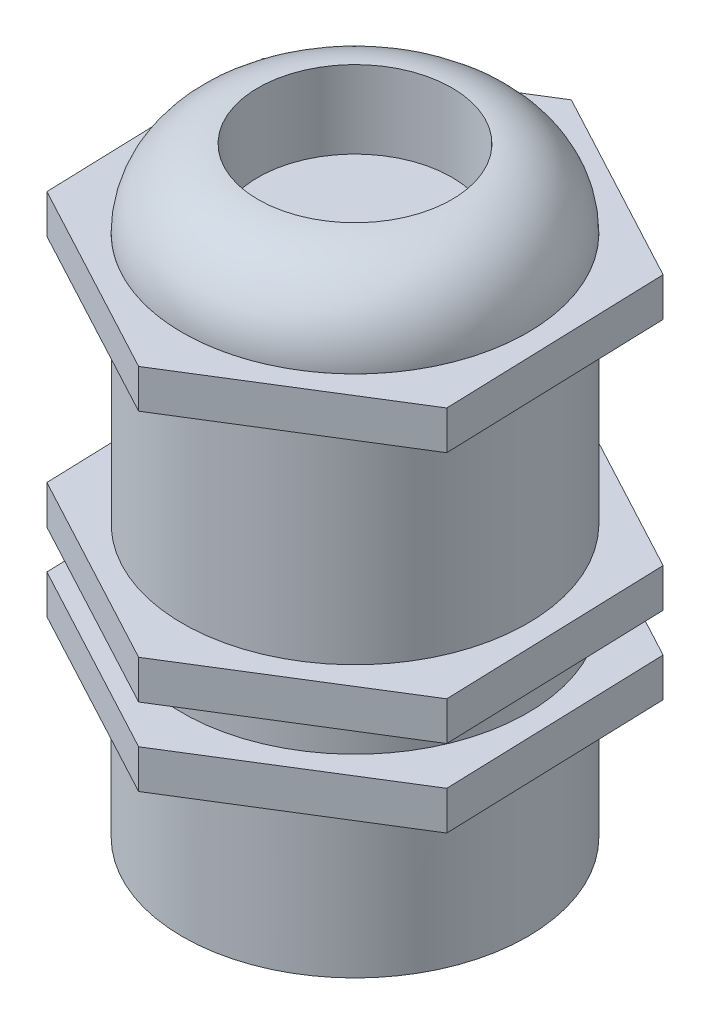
ISO-10303-21;
HEADER;
FILE_DESCRIPTION(('STEP AP214'),'2;1');
FILE_NAME('part.step','',(''),(''),'','','');
FILE_SCHEMA(('AUTOMOTIVE_DESIGN { 1 0 10303 214 1 1 1 1 }'));
ENDSEC;
DATA;
#1=APPLICATION_CONTEXT('core data for automotive mechanical design processes');
#2=APPLICATION_PROTOCOL_DEFINITION('international standard','automotive_design',2000,#1);
#3=PRODUCT_CONTEXT('',#1,'mechanical');
#4=PRODUCT('Part','Part','',(#3));
#5=PRODUCT_RELATED_PRODUCT_CATEGORY('part','',(#4));
#6=PRODUCT_DEFINITION_FORMATION('','',#4);
#7=PRODUCT_DEFINITION_CONTEXT('part definition',#1,'design');
#8=PRODUCT_DEFINITION('design','',#6,#7);
#9=PRODUCT_DEFINITION_SHAPE('','',#8);
#10=(LENGTH_UNIT() NAMED_UNIT(*) SI_UNIT(.MILLI.,.METRE.));
#11=(NAMED_UNIT(*) PLANE_ANGLE_UNIT() SI_UNIT($,.RADIAN.));
#12=(NAMED_UNIT(*) SI_UNIT($,.STERADIAN.) SOLID_ANGLE_UNIT());
#13=UNCERTAINTY_MEASURE_WITH_UNIT(LENGTH_MEASURE(1.E-05),#10,'distance_accuracy_value','');
#14=(GEOMETRIC_REPRESENTATION_CONTEXT(3) GLOBAL_UNCERTAINTY_ASSIGNED_CONTEXT((#13)) GLOBAL_UNIT_ASSIGNED_CONTEXT((#10,
#11,#12)) REPRESENTATION_CONTEXT('',''));
#15=CARTESIAN_POINT('',(0.,0.,0.));
#16=DIRECTION('',(0.,0.,1.));
#17=DIRECTION('',(1.,0.,0.));
#18=AXIS2_PLACEMENT_3D('',#15,#16,#17);
#19=CARTESIAN_POINT('',(0.,31.,0.));
#20=DIRECTION('',(0.,-1.,0.));
#21=DIRECTION('',(0.,0.,-1.));
#22=AXIS2_PLACEMENT_3D('',#19,#20,#21);
#23=CYLINDRICAL_SURFACE('',#22,8.9);
#24=CARTESIAN_POINT('',(0.,12.,0.));
#25=DIRECTION('',(0.,-1.,0.));
#26=DIRECTION('',(0.,0.,-1.));
#27=AXIS2_PLACEMENT_3D('',#24,#25,#26);
#28=CIRCLE('',#27,8.9);
#29=CARTESIAN_POINT('',(0.,12.,-8.9));
#30=VERTEX_POINT('',#29);
#31=EDGE_CURVE('E133',#30,#30,#28,.T.);
#32=ORIENTED_EDGE('',*,*,#31,.T.);
#33=EDGE_LOOP('',(#32));
#34=FACE_BOUND('',#33,.T.);
#35=CARTESIAN_POINT('',(0.,10.,0.));
#36=DIRECTION('',(0.,-1.,0.));
#37=DIRECTION('',(0.,0.,-1.));
#38=AXIS2_PLACEMENT_3D('',#35,#36,#37);
#39=CIRCLE('',#38,8.9);
#40=CARTESIAN_POINT('',(0.,10.,-8.9));
#41=VERTEX_POINT('',#40);
#42=EDGE_CURVE('E11',#41,#41,#39,.T.);
#43=ORIENTED_EDGE('',*,*,#42,.F.);
#44=EDGE_LOOP('',(#43));
#45=FACE_BOUND('',#44,.T.);
#46=ADVANCED_FACE('F35',(#34,#45),#23,.T.);
#47=CARTESIAN_POINT('',(0.,25.,0.));
#48=DIRECTION('',(0.,-1.,0.));
#49=DIRECTION('',(0.,0.,-1.));
#50=AXIS2_PLACEMENT_3D('',#47,#48,#49);
#51=CIRCLE('',#50,8.9);
#52=CARTESIAN_POINT('',(0.,25.,-8.9));
#53=VERTEX_POINT('',#52);
#54=EDGE_CURVE('E155',#53,#53,#51,.T.);
#55=ORIENTED_EDGE('',*,*,#54,.T.);
#56=EDGE_LOOP('',(#55));
#57=FACE_BOUND('',#56,.T.);
#58=CARTESIAN_POINT('',(0.,14.,0.));
#59=DIRECTION('',(0.,-1.,0.));
#60=DIRECTION('',(0.,0.,-1.));
#61=AXIS2_PLACEMENT_3D('',#58,#59,#60);
#62=CIRCLE('',#61,8.9);
#63=CARTESIAN_POINT('',(0.,14.,-8.9));
#64=VERTEX_POINT('',#63);
#65=EDGE_CURVE('E176',#64,#64,#62,.T.);
#66=ORIENTED_EDGE('',*,*,#65,.F.);
#67=EDGE_LOOP('',(#66));
#68=FACE_BOUND('',#67,.T.);
#69=ADVANCED_FACE('F215',(#57,#68),#23,.T.);
#70=CARTESIAN_POINT('',(0.,25.,0.));
#71=DIRECTION('',(0.,-1.,0.));
#72=DIRECTION('',(0.,0.,-1.));
#73=AXIS2_PLACEMENT_3D('',#70,#71,#72);
#74=PLANE('',#73);
#75=DIRECTION('',(0.849366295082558,0.,-0.527803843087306));
#76=VECTOR('',#75,1.);
#77=CARTESIAN_POINT('',(-10.1818570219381,25.,-5.4463860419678));
#78=LINE('',#77,#76);
#79=CARTESIAN_POINT('',(-10.1818570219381,25.,-5.4463860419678));
#80=VERTEX_POINT('',#79);
#81=CARTESIAN_POINT('',(-0.374219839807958,25.,-11.5409398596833));
#82=VERTEX_POINT('',#81);
#83=EDGE_CURVE('E140',#80,#82,#78,.T.);
#84=ORIENTED_EDGE('',*,*,#83,.T.);
#85=DIRECTION('',(0.881774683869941,0.,0.471670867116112));
#86=VECTOR('',#85,1.);
#87=CARTESIAN_POINT('',(-0.374219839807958,25.,-11.5409398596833));
#88=LINE('',#87,#86);
#89=CARTESIAN_POINT('',(9.80763718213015,25.,-6.09455381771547));
#90=VERTEX_POINT('',#89);
#91=EDGE_CURVE('E94',#82,#90,#88,.T.);
#92=ORIENTED_EDGE('',*,*,#91,.T.);
#93=DIRECTION('',(0.0324083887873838,0.,0.999474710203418));
#94=VECTOR('',#93,1.);
#95=CARTESIAN_POINT('',(9.80763718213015,25.,-6.09455381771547));
#96=LINE('',#95,#94);
#97=CARTESIAN_POINT('',(10.1818570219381,25.,5.4463860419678));
#98=VERTEX_POINT('',#97);
#99=EDGE_CURVE('E111',#90,#98,#96,.T.);
#100=ORIENTED_EDGE('',*,*,#99,.T.);
#101=DIRECTION('',(-0.849366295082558,0.,0.527803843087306));
#102=VECTOR('',#101,1.);
#103=CARTESIAN_POINT('',(10.1818570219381,25.,5.4463860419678));
#104=LINE('',#103,#102);
#105=CARTESIAN_POINT('',(0.374219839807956,25.,11.5409398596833));
#106=VERTEX_POINT('',#105);
#107=EDGE_CURVE('E104',#98,#106,#104,.T.);
#108=ORIENTED_EDGE('',*,*,#107,.T.);
#109=DIRECTION('',(-0.881774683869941,0.,-0.471670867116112));
#110=VECTOR('',#109,1.);
#111=CARTESIAN_POINT('',(0.374219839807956,25.,11.5409398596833));
#112=LINE('',#111,#110);
#113=CARTESIAN_POINT('',(-9.80763718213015,25.,6.09455381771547));
#114=VERTEX_POINT('',#113);
#115=EDGE_CURVE('E109',#106,#114,#112,.T.);
#116=ORIENTED_EDGE('',*,*,#115,.T.);
#117=DIRECTION('',(-0.0324083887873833,0.,-0.999474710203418));
#118=VECTOR('',#117,1.);
#119=CARTESIAN_POINT('',(-9.80763718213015,25.,6.09455381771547));
#120=LINE('',#119,#118);
#121=EDGE_CURVE('E55',#114,#80,#120,.T.);
#122=ORIENTED_EDGE('',*,*,#121,.T.);
#123=EDGE_LOOP('',(#84,#92,#100,#108,#116,#122));
#124=FACE_BOUND('',#123,.T.);
#125=ORIENTED_EDGE('',*,*,#54,.F.);
#126=EDGE_LOOP('',(#125));
#127=FACE_BOUND('',#126,.T.);
#128=ADVANCED_FACE('F106',(#124,#127),#74,.T.);
#129=CARTESIAN_POINT('',(0.,27.,0.));
#130=DIRECTION('',(0.,-1.,0.));
#131=DIRECTION('',(0.,0.,-1.));
#132=AXIS2_PLACEMENT_3D('',#129,#130,#131);
#133=PLANE('',#132);
#134=DIRECTION('',(0.849366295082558,0.,-0.527803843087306));
#135=VECTOR('',#134,1.);
#136=CARTESIAN_POINT('',(-10.1818570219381,27.,-5.4463860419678));
#137=LINE('',#136,#135);
#138=CARTESIAN_POINT('',(-10.1818570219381,27.,-5.4463860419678));
#139=VERTEX_POINT('',#138);
#140=CARTESIAN_POINT('',(-0.374219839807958,27.,-11.5409398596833));
#141=VERTEX_POINT('',#140);
#142=EDGE_CURVE('E129',#139,#141,#137,.T.);
#143=ORIENTED_EDGE('',*,*,#142,.F.);
#144=DIRECTION('',(-0.0324083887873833,0.,-0.999474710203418));
#145=VECTOR('',#144,1.);
#146=CARTESIAN_POINT('',(-9.80763718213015,27.,6.09455381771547));
#147=LINE('',#146,#145);
#148=CARTESIAN_POINT('',(-9.80763718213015,27.,6.09455381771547));
#149=VERTEX_POINT('',#148);
#150=EDGE_CURVE('E85',#149,#139,#147,.T.);
#151=ORIENTED_EDGE('',*,*,#150,.F.);
#152=DIRECTION('',(-0.881774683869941,0.,-0.471670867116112));
#153=VECTOR('',#152,1.);
#154=CARTESIAN_POINT('',(0.374219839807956,27.,11.5409398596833));
#155=LINE('',#154,#153);
#156=CARTESIAN_POINT('',(0.374219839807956,27.,11.5409398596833));
#157=VERTEX_POINT('',#156);
#158=EDGE_CURVE('E79',#157,#149,#155,.T.);
#159=ORIENTED_EDGE('',*,*,#158,.F.);
#160=DIRECTION('',(-0.849366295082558,0.,0.527803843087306));
#161=VECTOR('',#160,1.);
#162=CARTESIAN_POINT('',(10.1818570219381,27.,5.4463860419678));
#163=LINE('',#162,#161);
#164=CARTESIAN_POINT('',(10.1818570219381,27.,5.4463860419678));
#165=VERTEX_POINT('',#164);
#166=EDGE_CURVE('E119',#165,#157,#163,.T.);
#167=ORIENTED_EDGE('',*,*,#166,.F.);
#168=DIRECTION('',(0.0324083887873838,0.,0.999474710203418));
#169=VECTOR('',#168,1.);
#170=CARTESIAN_POINT('',(9.80763718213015,27.,-6.09455381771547));
#171=LINE('',#170,#169);
#172=CARTESIAN_POINT('',(9.80763718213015,27.,-6.09455381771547));
#173=VERTEX_POINT('',#172);
#174=EDGE_CURVE('E135',#173,#165,#171,.T.);
#175=ORIENTED_EDGE('',*,*,#174,.F.);
#176=DIRECTION('',(0.881774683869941,0.,0.471670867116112));
#177=VECTOR('',#176,1.);
#178=CARTESIAN_POINT('',(-0.374219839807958,27.,-11.5409398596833));
#179=LINE('',#178,#177);
#180=EDGE_CURVE('E132',#141,#173,#179,.T.);
#181=ORIENTED_EDGE('',*,*,#180,.F.);
#182=EDGE_LOOP('',(#143,#151,#159,#167,#175,#181));
#183=FACE_BOUND('',#182,.T.);
#184=CARTESIAN_POINT('',(0.,27.,0.));
#185=DIRECTION('',(0.,-1.,0.));
#186=DIRECTION('',(0.,0.,-1.));
#187=AXIS2_PLACEMENT_3D('',#184,#185,#186);
#188=CIRCLE('',#187,8.9);
#189=CARTESIAN_POINT('',(0.,27.,-8.9));
#190=VERTEX_POINT('',#189);
#191=EDGE_CURVE('E150',#190,#190,#188,.T.);
#192=ORIENTED_EDGE('',*,*,#191,.T.);
#193=EDGE_LOOP('',(#192));
#194=FACE_BOUND('',#193,.T.);
#195=ADVANCED_FACE('F201',(#183,#194),#133,.F.);
#196=CARTESIAN_POINT('',(-10.1818570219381,25.,-5.4463860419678));
#197=DIRECTION('',(0.527803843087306,0.,0.849366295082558));
#198=DIRECTION('',(0.849366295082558,0.,-0.527803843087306));
#199=AXIS2_PLACEMENT_3D('',#196,#197,#198);
#200=PLANE('',#199);
#201=ORIENTED_EDGE('',*,*,#142,.T.);
#202=DIRECTION('',(0.,1.,0.));
#203=VECTOR('',#202,1.);
#204=CARTESIAN_POINT('',(-0.374219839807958,25.,-11.5409398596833));
#205=LINE('',#204,#203);
#206=EDGE_CURVE('E147',#82,#141,#205,.T.);
#207=ORIENTED_EDGE('',*,*,#206,.F.);
#208=ORIENTED_EDGE('',*,*,#83,.F.);
#209=DIRECTION('',(0.,1.,0.));
#210=VECTOR('',#209,1.);
#211=CARTESIAN_POINT('',(-10.1818570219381,25.,-5.4463860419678));
#212=LINE('',#211,#210);
#213=EDGE_CURVE('E125',#80,#139,#212,.T.);
#214=ORIENTED_EDGE('',*,*,#213,.T.);
#215=EDGE_LOOP('',(#201,#207,#208,#214));
#216=FACE_BOUND('',#215,.T.);
#217=ADVANCED_FACE('F204',(#216),#200,.F.);
#218=CARTESIAN_POINT('',(-0.374219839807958,25.,-11.5409398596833));
#219=DIRECTION('',(-0.471670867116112,0.,0.881774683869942));
#220=DIRECTION('',(0.881774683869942,0.,0.471670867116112));
#221=AXIS2_PLACEMENT_3D('',#218,#219,#220);
#222=PLANE('',#221);
#223=ORIENTED_EDGE('',*,*,#180,.T.);
#224=DIRECTION('',(0.,1.,0.));
#225=VECTOR('',#224,1.);
#226=CARTESIAN_POINT('',(9.80763718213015,25.,-6.09455381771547));
#227=LINE('',#226,#225);
#228=EDGE_CURVE('E144',#90,#173,#227,.T.);
#229=ORIENTED_EDGE('',*,*,#228,.F.);
#230=ORIENTED_EDGE('',*,*,#91,.F.);
#231=ORIENTED_EDGE('',*,*,#206,.T.);
#232=EDGE_LOOP('',(#223,#229,#230,#231));
#233=FACE_BOUND('',#232,.T.);
#234=ADVANCED_FACE('F195',(#233),#222,.F.);
#235=CARTESIAN_POINT('',(9.80763718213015,25.,-6.09455381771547));
#236=DIRECTION('',(-0.999474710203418,0.,0.0324083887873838));
#237=DIRECTION('',(0.0324083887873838,0.,0.999474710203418));
#238=AXIS2_PLACEMENT_3D('',#235,#236,#237);
#239=PLANE('',#238);
#240=ORIENTED_EDGE('',*,*,#174,.T.);
#241=DIRECTION('',(0.,1.,0.));
#242=VECTOR('',#241,1.);
#243=CARTESIAN_POINT('',(10.1818570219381,25.,5.4463860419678));
#244=LINE('',#243,#242);
#245=EDGE_CURVE('E120',#98,#165,#244,.T.);
#246=ORIENTED_EDGE('',*,*,#245,.F.);
#247=ORIENTED_EDGE('',*,*,#99,.F.);
#248=ORIENTED_EDGE('',*,*,#228,.T.);
#249=EDGE_LOOP('',(#240,#246,#247,#248));
#250=FACE_BOUND('',#249,.T.);
#251=ADVANCED_FACE('F198',(#250),#239,.F.);
#252=CARTESIAN_POINT('',(10.1818570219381,25.,5.4463860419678));
#253=DIRECTION('',(-0.527803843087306,0.,-0.849366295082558));
#254=DIRECTION('',(-0.849366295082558,0.,0.527803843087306));
#255=AXIS2_PLACEMENT_3D('',#252,#253,#254);
#256=PLANE('',#255);
#257=ORIENTED_EDGE('',*,*,#166,.T.);
#258=DIRECTION('',(0.,1.,0.));
#259=VECTOR('',#258,1.);
#260=CARTESIAN_POINT('',(0.374219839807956,25.,11.5409398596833));
#261=LINE('',#260,#259);
#262=EDGE_CURVE('E116',#106,#157,#261,.T.);
#263=ORIENTED_EDGE('',*,*,#262,.F.);
#264=ORIENTED_EDGE('',*,*,#107,.F.);
#265=ORIENTED_EDGE('',*,*,#245,.T.);
#266=EDGE_LOOP('',(#257,#263,#264,#265));
#267=FACE_BOUND('',#266,.T.);
#268=ADVANCED_FACE('F117',(#267),#256,.F.);
#269=CARTESIAN_POINT('',(0.374219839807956,25.,11.5409398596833));
#270=DIRECTION('',(0.471670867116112,0.,-0.881774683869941));
#271=DIRECTION('',(-0.881774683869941,0.,-0.471670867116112));
#272=AXIS2_PLACEMENT_3D('',#269,#270,#271);
#273=PLANE('',#272);
#274=ORIENTED_EDGE('',*,*,#158,.T.);
#275=DIRECTION('',(0.,1.,0.));
#276=VECTOR('',#275,1.);
#277=CARTESIAN_POINT('',(-9.80763718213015,25.,6.09455381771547));
#278=LINE('',#277,#276);
#279=EDGE_CURVE('E121',#114,#149,#278,.T.);
#280=ORIENTED_EDGE('',*,*,#279,.F.);
#281=ORIENTED_EDGE('',*,*,#115,.F.);
#282=ORIENTED_EDGE('',*,*,#262,.T.);
#283=EDGE_LOOP('',(#274,#280,#281,#282));
#284=FACE_BOUND('',#283,.T.);
#285=ADVANCED_FACE('F123',(#284),#273,.F.);
#286=CARTESIAN_POINT('',(-9.80763718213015,25.,6.09455381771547));
#287=DIRECTION('',(0.999474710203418,0.,-0.0324083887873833));
#288=DIRECTION('',(-0.0324083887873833,0.,-0.999474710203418));
#289=AXIS2_PLACEMENT_3D('',#286,#287,#288);
#290=PLANE('',#289);
#291=ORIENTED_EDGE('',*,*,#150,.T.);
#292=ORIENTED_EDGE('',*,*,#213,.F.);
#293=ORIENTED_EDGE('',*,*,#121,.F.);
#294=ORIENTED_EDGE('',*,*,#279,.T.);
#295=EDGE_LOOP('',(#291,#292,#293,#294));
#296=FACE_BOUND('',#295,.T.);
#297=ADVANCED_FACE('F205',(#296),#290,.F.);
#298=CARTESIAN_POINT('',(0.,27.0012501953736,0.));
#299=DIRECTION('',(0.,1.,0.));
#300=DIRECTION('',(0.,0.,1.));
#301=AXIS2_PLACEMENT_3D('',#298,#299,#300);
#302=CIRCLE('',#301,8.9);
#303=CARTESIAN_POINT('',(0.,27.0012501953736,8.9));
#304=VERTEX_POINT('',#303);
#305=EDGE_CURVE('E167',#304,#304,#302,.F.);
#306=ORIENTED_EDGE('',*,*,#305,.T.);
#307=EDGE_LOOP('',(#306));
#308=FACE_BOUND('',#307,.T.);
#309=ORIENTED_EDGE('',*,*,#191,.F.);
#310=EDGE_LOOP('',(#309));
#311=FACE_BOUND('',#310,.T.);
#312=ADVANCED_FACE('F207',(#308,#311),#23,.T.);
#313=CARTESIAN_POINT('',(0.,27.0012501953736,0.));
#314=DIRECTION('',(0.,1.,0.));
#315=DIRECTION('',(0.,0.,1.));
#316=AXIS2_PLACEMENT_3D('',#313,#314,#315);
#317=TOROIDAL_SURFACE('',#316,4.9,4.);
#318=ORIENTED_EDGE('',*,*,#305,.F.);
#319=EDGE_LOOP('',(#318));
#320=FACE_BOUND('',#319,.T.);
#321=CARTESIAN_POINT('',(0.,31.,0.));
#322=DIRECTION('',(0.,1.,0.));
#323=DIRECTION('',(0.,0.,1.));
#324=AXIS2_PLACEMENT_3D('',#321,#322,#323);
#325=CIRCLE('',#324,5.);
#326=CARTESIAN_POINT('',(0.,31.,5.));
#327=VERTEX_POINT('',#326);
#328=EDGE_CURVE('E158',#327,#327,#325,.T.);
#329=ORIENTED_EDGE('',*,*,#328,.F.);
#330=EDGE_LOOP('',(#329));
#331=FACE_BOUND('',#330,.T.);
#332=ADVANCED_FACE('F37',(#320,#331),#317,.T.);
#333=CARTESIAN_POINT('',(0.,0.,0.));
#334=DIRECTION('',(0.,1.,0.));
#335=DIRECTION('',(0.,0.,1.));
#336=AXIS2_PLACEMENT_3D('',#333,#334,#335);
#337=CYLINDRICAL_SURFACE('',#336,5.);
#338=ORIENTED_EDGE('',*,*,#328,.T.);
#339=EDGE_LOOP('',(#338));
#340=FACE_BOUND('',#339,.T.);
#341=CARTESIAN_POINT('',(0.,27.,0.));
#342=DIRECTION('',(0.,-1.,0.));
#343=DIRECTION('',(0.,0.,-1.));
#344=AXIS2_PLACEMENT_3D('',#341,#342,#343);
#345=CIRCLE('',#344,5.);
#346=CARTESIAN_POINT('',(0.,27.,-5.));
#347=VERTEX_POINT('',#346);
#348=EDGE_CURVE('E154',#347,#347,#345,.F.);
#349=ORIENTED_EDGE('',*,*,#348,.F.);
#350=EDGE_LOOP('',(#349));
#351=FACE_BOUND('',#350,.T.);
#352=ADVANCED_FACE('F500',(#340,#351),#337,.F.);
#353=ORIENTED_EDGE('',*,*,#348,.T.);
#354=EDGE_LOOP('',(#353));
#355=FACE_BOUND('',#354,.T.);
#356=ADVANCED_FACE('F495',(#355),#133,.F.);
#357=CARTESIAN_POINT('',(0.,12.,0.));
#358=DIRECTION('',(0.,-1.,0.));
#359=DIRECTION('',(0.,0.,-1.));
#360=AXIS2_PLACEMENT_3D('',#357,#358,#359);
#361=PLANE('',#360);
#362=DIRECTION('',(0.849366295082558,0.,-0.527803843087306));
#363=VECTOR('',#362,1.);
#364=CARTESIAN_POINT('',(-10.1818570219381,12.,-5.4463860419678));
#365=LINE('',#364,#363);
#366=CARTESIAN_POINT('',(-10.1818570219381,12.,-5.4463860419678));
#367=VERTEX_POINT('',#366);
#368=CARTESIAN_POINT('',(-0.374219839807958,12.,-11.5409398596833));
#369=VERTEX_POINT('',#368);
#370=EDGE_CURVE('E255',#367,#369,#365,.T.);
#371=ORIENTED_EDGE('',*,*,#370,.T.);
#372=DIRECTION('',(0.881774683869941,0.,0.471670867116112));
#373=VECTOR('',#372,1.);
#374=CARTESIAN_POINT('',(-0.374219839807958,12.,-11.5409398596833));
#375=LINE('',#374,#373);
#376=CARTESIAN_POINT('',(9.80763718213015,12.,-6.09455381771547));
#377=VERTEX_POINT('',#376);
#378=EDGE_CURVE('E258',#369,#377,#375,.T.);
#379=ORIENTED_EDGE('',*,*,#378,.T.);
#380=DIRECTION('',(0.0324083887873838,0.,0.999474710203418));
#381=VECTOR('',#380,1.);
#382=CARTESIAN_POINT('',(9.80763718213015,12.,-6.09455381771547));
#383=LINE('',#382,#381);
#384=CARTESIAN_POINT('',(10.1818570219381,12.,5.4463860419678));
#385=VERTEX_POINT('',#384);
#386=EDGE_CURVE('E262',#377,#385,#383,.T.);
#387=ORIENTED_EDGE('',*,*,#386,.T.);
#388=DIRECTION('',(-0.849366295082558,0.,0.527803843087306));
#389=VECTOR('',#388,1.);
#390=CARTESIAN_POINT('',(10.1818570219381,12.,5.4463860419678));
#391=LINE('',#390,#389);
#392=CARTESIAN_POINT('',(0.374219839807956,12.,11.5409398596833));
#393=VERTEX_POINT('',#392);
#394=EDGE_CURVE('E265',#385,#393,#391,.T.);
#395=ORIENTED_EDGE('',*,*,#394,.T.);
#396=DIRECTION('',(-0.881774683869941,0.,-0.471670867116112));
#397=VECTOR('',#396,1.);
#398=CARTESIAN_POINT('',(0.374219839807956,12.,11.5409398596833));
#399=LINE('',#398,#397);
#400=CARTESIAN_POINT('',(-9.80763718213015,12.,6.09455381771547));
#401=VERTEX_POINT('',#400);
#402=EDGE_CURVE('E268',#393,#401,#399,.T.);
#403=ORIENTED_EDGE('',*,*,#402,.T.);
#404=DIRECTION('',(-0.0324083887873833,0.,-0.999474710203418));
#405=VECTOR('',#404,1.);
#406=CARTESIAN_POINT('',(-9.80763718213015,12.,6.09455381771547));
#407=LINE('',#406,#405);
#408=EDGE_CURVE('E271',#401,#367,#407,.T.);
#409=ORIENTED_EDGE('',*,*,#408,.T.);
#410=EDGE_LOOP('',(#371,#379,#387,#395,#403,#409));
#411=FACE_BOUND('',#410,.T.);
#412=ORIENTED_EDGE('',*,*,#31,.F.);
#413=EDGE_LOOP('',(#412));
#414=FACE_BOUND('',#413,.T.);
#415=ADVANCED_FACE('F472',(#411,#414),#361,.T.);
#416=CARTESIAN_POINT('',(0.,14.,0.));
#417=DIRECTION('',(0.,-1.,0.));
#418=DIRECTION('',(0.,0.,-1.));
#419=AXIS2_PLACEMENT_3D('',#416,#417,#418);
#420=PLANE('',#419);
#421=DIRECTION('',(0.849366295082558,0.,-0.527803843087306));
#422=VECTOR('',#421,1.);
#423=CARTESIAN_POINT('',(-10.1818570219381,14.,-5.4463860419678));
#424=LINE('',#423,#422);
#425=CARTESIAN_POINT('',(-10.1818570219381,14.,-5.4463860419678));
#426=VERTEX_POINT('',#425);
#427=CARTESIAN_POINT('',(-0.374219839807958,14.,-11.5409398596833));
#428=VERTEX_POINT('',#427);
#429=EDGE_CURVE('E246',#426,#428,#424,.T.);
#430=ORIENTED_EDGE('',*,*,#429,.F.);
#431=DIRECTION('',(-0.0324083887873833,0.,-0.999474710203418));
#432=VECTOR('',#431,1.);
#433=CARTESIAN_POINT('',(-9.80763718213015,14.,6.09455381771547));
#434=LINE('',#433,#432);
#435=CARTESIAN_POINT('',(-9.80763718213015,14.,6.09455381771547));
#436=VERTEX_POINT('',#435);
#437=EDGE_CURVE('E259',#436,#426,#434,.T.);
#438=ORIENTED_EDGE('',*,*,#437,.F.);
#439=DIRECTION('',(-0.881774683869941,0.,-0.471670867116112));
#440=VECTOR('',#439,1.);
#441=CARTESIAN_POINT('',(0.374219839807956,14.,11.5409398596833));
#442=LINE('',#441,#440);
#443=CARTESIAN_POINT('',(0.374219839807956,14.,11.5409398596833));
#444=VERTEX_POINT('',#443);
#445=EDGE_CURVE('E283',#444,#436,#442,.T.);
#446=ORIENTED_EDGE('',*,*,#445,.F.);
#447=DIRECTION('',(-0.849366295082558,0.,0.527803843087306));
#448=VECTOR('',#447,1.);
#449=CARTESIAN_POINT('',(10.1818570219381,14.,5.4463860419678));
#450=LINE('',#449,#448);
#451=CARTESIAN_POINT('',(10.1818570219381,14.,5.4463860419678));
#452=VERTEX_POINT('',#451);
#453=EDGE_CURVE('E280',#452,#444,#450,.T.);
#454=ORIENTED_EDGE('',*,*,#453,.F.);
#455=DIRECTION('',(0.0324083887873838,0.,0.999474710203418));
#456=VECTOR('',#455,1.);
#457=CARTESIAN_POINT('',(9.80763718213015,14.,-6.09455381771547));
#458=LINE('',#457,#456);
#459=CARTESIAN_POINT('',(9.80763718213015,14.,-6.09455381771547));
#460=VERTEX_POINT('',#459);
#461=EDGE_CURVE('E277',#460,#452,#458,.T.);
#462=ORIENTED_EDGE('',*,*,#461,.F.);
#463=DIRECTION('',(0.881774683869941,0.,0.471670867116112));
#464=VECTOR('',#463,1.);
#465=CARTESIAN_POINT('',(-0.374219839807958,14.,-11.5409398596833));
#466=LINE('',#465,#464);
#467=EDGE_CURVE('E249',#428,#460,#466,.T.);
#468=ORIENTED_EDGE('',*,*,#467,.F.);
#469=EDGE_LOOP('',(#430,#438,#446,#454,#462,#468));
#470=FACE_BOUND('',#469,.T.);
#471=ORIENTED_EDGE('',*,*,#65,.T.);
#472=EDGE_LOOP('',(#471));
#473=FACE_BOUND('',#472,.T.);
#474=ADVANCED_FACE('F322',(#470,#473),#420,.F.);
#475=CARTESIAN_POINT('',(-10.1818570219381,12.,-5.4463860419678));
#476=DIRECTION('',(0.527803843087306,0.,0.849366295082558));
#477=DIRECTION('',(0.849366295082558,0.,-0.527803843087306));
#478=AXIS2_PLACEMENT_3D('',#475,#476,#477);
#479=PLANE('',#478);
#480=ORIENTED_EDGE('',*,*,#429,.T.);
#481=DIRECTION('',(0.,1.,0.));
#482=VECTOR('',#481,1.);
#483=CARTESIAN_POINT('',(-0.374219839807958,12.,-11.5409398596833));
#484=LINE('',#483,#482);
#485=EDGE_CURVE('E179',#369,#428,#484,.T.);
#486=ORIENTED_EDGE('',*,*,#485,.F.);
#487=ORIENTED_EDGE('',*,*,#370,.F.);
#488=DIRECTION('',(0.,1.,0.));
#489=VECTOR('',#488,1.);
#490=CARTESIAN_POINT('',(-10.1818570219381,12.,-5.4463860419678));
#491=LINE('',#490,#489);
#492=EDGE_CURVE('E273',#367,#426,#491,.T.);
#493=ORIENTED_EDGE('',*,*,#492,.T.);
#494=EDGE_LOOP('',(#480,#486,#487,#493));
#495=FACE_BOUND('',#494,.T.);
#496=ADVANCED_FACE('F318',(#495),#479,.F.);
#497=CARTESIAN_POINT('',(-0.374219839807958,12.,-11.5409398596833));
#498=DIRECTION('',(-0.471670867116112,0.,0.881774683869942));
#499=DIRECTION('',(0.881774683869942,0.,0.471670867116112));
#500=AXIS2_PLACEMENT_3D('',#497,#498,#499);
#501=PLANE('',#500);
#502=ORIENTED_EDGE('',*,*,#467,.T.);
#503=DIRECTION('',(0.,1.,0.));
#504=VECTOR('',#503,1.);
#505=CARTESIAN_POINT('',(9.80763718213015,12.,-6.09455381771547));
#506=LINE('',#505,#504);
#507=EDGE_CURVE('E298',#377,#460,#506,.T.);
#508=ORIENTED_EDGE('',*,*,#507,.F.);
#509=ORIENTED_EDGE('',*,*,#378,.F.);
#510=ORIENTED_EDGE('',*,*,#485,.T.);
#511=EDGE_LOOP('',(#502,#508,#509,#510));
#512=FACE_BOUND('',#511,.T.);
#513=ADVANCED_FACE('F310',(#512),#501,.F.);
#514=CARTESIAN_POINT('',(9.80763718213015,12.,-6.09455381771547));
#515=DIRECTION('',(-0.999474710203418,0.,0.0324083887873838));
#516=DIRECTION('',(0.0324083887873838,0.,0.999474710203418));
#517=AXIS2_PLACEMENT_3D('',#514,#515,#516);
#518=PLANE('',#517);
#519=ORIENTED_EDGE('',*,*,#461,.T.);
#520=DIRECTION('',(0.,1.,0.));
#521=VECTOR('',#520,1.);
#522=CARTESIAN_POINT('',(10.1818570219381,12.,5.4463860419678));
#523=LINE('',#522,#521);
#524=EDGE_CURVE('E296',#385,#452,#523,.T.);
#525=ORIENTED_EDGE('',*,*,#524,.F.);
#526=ORIENTED_EDGE('',*,*,#386,.F.);
#527=ORIENTED_EDGE('',*,*,#507,.T.);
#528=EDGE_LOOP('',(#519,#525,#526,#527));
#529=FACE_BOUND('',#528,.T.);
#530=ADVANCED_FACE('F631',(#529),#518,.F.);
#531=CARTESIAN_POINT('',(10.1818570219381,12.,5.4463860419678));
#532=DIRECTION('',(-0.527803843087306,0.,-0.849366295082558));
#533=DIRECTION('',(-0.849366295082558,0.,0.527803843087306));
#534=AXIS2_PLACEMENT_3D('',#531,#532,#533);
#535=PLANE('',#534);
#536=ORIENTED_EDGE('',*,*,#453,.T.);
#537=DIRECTION('',(0.,1.,0.));
#538=VECTOR('',#537,1.);
#539=CARTESIAN_POINT('',(0.374219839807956,12.,11.5409398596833));
#540=LINE('',#539,#538);
#541=EDGE_CURVE('E293',#393,#444,#540,.T.);
#542=ORIENTED_EDGE('',*,*,#541,.F.);
#543=ORIENTED_EDGE('',*,*,#394,.F.);
#544=ORIENTED_EDGE('',*,*,#524,.T.);
#545=EDGE_LOOP('',(#536,#542,#543,#544));
#546=FACE_BOUND('',#545,.T.);
#547=ADVANCED_FACE('F624',(#546),#535,.F.);
#548=CARTESIAN_POINT('',(0.374219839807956,12.,11.5409398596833));
#549=DIRECTION('',(0.471670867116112,0.,-0.881774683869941));
#550=DIRECTION('',(-0.881774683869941,0.,-0.471670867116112));
#551=AXIS2_PLACEMENT_3D('',#548,#549,#550);
#552=PLANE('',#551);
#553=ORIENTED_EDGE('',*,*,#445,.T.);
#554=DIRECTION('',(0.,1.,0.));
#555=VECTOR('',#554,1.);
#556=CARTESIAN_POINT('',(-9.80763718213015,12.,6.09455381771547));
#557=LINE('',#556,#555);
#558=EDGE_CURVE('E290',#401,#436,#557,.T.);
#559=ORIENTED_EDGE('',*,*,#558,.F.);
#560=ORIENTED_EDGE('',*,*,#402,.F.);
#561=ORIENTED_EDGE('',*,*,#541,.T.);
#562=EDGE_LOOP('',(#553,#559,#560,#561));
#563=FACE_BOUND('',#562,.T.);
#564=ADVANCED_FACE('F621',(#563),#552,.F.);
#565=CARTESIAN_POINT('',(-9.80763718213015,12.,6.09455381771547));
#566=DIRECTION('',(0.999474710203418,0.,-0.0324083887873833));
#567=DIRECTION('',(-0.0324083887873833,0.,-0.999474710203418));
#568=AXIS2_PLACEMENT_3D('',#565,#566,#567);
#569=PLANE('',#568);
#570=ORIENTED_EDGE('',*,*,#437,.T.);
#571=ORIENTED_EDGE('',*,*,#492,.F.);
#572=ORIENTED_EDGE('',*,*,#408,.F.);
#573=ORIENTED_EDGE('',*,*,#558,.T.);
#574=EDGE_LOOP('',(#570,#571,#572,#573));
#575=FACE_BOUND('',#574,.T.);
#576=ADVANCED_FACE('F459',(#575),#569,.F.);
#577=CARTESIAN_POINT('',(0.,8.,0.));
#578=DIRECTION('',(0.,-1.,0.));
#579=DIRECTION('',(0.,0.,-1.));
#580=AXIS2_PLACEMENT_3D('',#577,#578,#579);
#581=PLANE('',#580);
#582=DIRECTION('',(0.849366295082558,0.,-0.527803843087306));
#583=VECTOR('',#582,1.);
#584=CARTESIAN_POINT('',(-10.1818570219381,8.,-5.4463860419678));
#585=LINE('',#584,#583);
#586=CARTESIAN_POINT('',(-10.1818570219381,8.,-5.4463860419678));
#587=VERTEX_POINT('',#586);
#588=CARTESIAN_POINT('',(-0.374219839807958,8.,-11.5409398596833));
#589=VERTEX_POINT('',#588);
#590=EDGE_CURVE('E391',#587,#589,#585,.T.);
#591=ORIENTED_EDGE('',*,*,#590,.T.);
#592=DIRECTION('',(0.881774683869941,0.,0.471670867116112));
#593=VECTOR('',#592,1.);
#594=CARTESIAN_POINT('',(-0.374219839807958,8.,-11.5409398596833));
#595=LINE('',#594,#593);
#596=CARTESIAN_POINT('',(9.80763718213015,8.,-6.09455381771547));
#597=VERTEX_POINT('',#596);
#598=EDGE_CURVE('E381',#589,#597,#595,.T.);
#599=ORIENTED_EDGE('',*,*,#598,.T.);
#600=DIRECTION('',(0.0324083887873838,0.,0.999474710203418));
#601=VECTOR('',#600,1.);
#602=CARTESIAN_POINT('',(9.80763718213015,8.,-6.09455381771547));
#603=LINE('',#602,#601);
#604=CARTESIAN_POINT('',(10.1818570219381,8.,5.4463860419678));
#605=VERTEX_POINT('',#604);
#606=EDGE_CURVE('E390',#597,#605,#603,.T.);
#607=ORIENTED_EDGE('',*,*,#606,.T.);
#608=DIRECTION('',(-0.849366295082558,0.,0.527803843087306));
#609=VECTOR('',#608,1.);
#610=CARTESIAN_POINT('',(10.1818570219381,8.,5.4463860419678));
#611=LINE('',#610,#609);
#612=CARTESIAN_POINT('',(0.374219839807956,8.,11.5409398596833));
#613=VERTEX_POINT('',#612);
#614=EDGE_CURVE('E431',#605,#613,#611,.T.);
#615=ORIENTED_EDGE('',*,*,#614,.T.);
#616=DIRECTION('',(-0.881774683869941,0.,-0.471670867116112));
#617=VECTOR('',#616,1.);
#618=CARTESIAN_POINT('',(0.374219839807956,8.,11.5409398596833));
#619=LINE('',#618,#617);
#620=CARTESIAN_POINT('',(-9.80763718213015,8.,6.09455381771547));
#621=VERTEX_POINT('',#620);
#622=EDGE_CURVE('E429',#613,#621,#619,.T.);
#623=ORIENTED_EDGE('',*,*,#622,.T.);
#624=DIRECTION('',(-0.0324083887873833,0.,-0.999474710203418));
#625=VECTOR('',#624,1.);
#626=CARTESIAN_POINT('',(-9.80763718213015,8.,6.09455381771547));
#627=LINE('',#626,#625);
#628=EDGE_CURVE('E396',#621,#587,#627,.T.);
#629=ORIENTED_EDGE('',*,*,#628,.T.);
#630=EDGE_LOOP('',(#591,#599,#607,#615,#623,#629));
#631=FACE_BOUND('',#630,.T.);
#632=CARTESIAN_POINT('',(0.,8.,0.));
#633=DIRECTION('',(0.,-1.,0.));
#634=DIRECTION('',(0.,0.,-1.));
#635=AXIS2_PLACEMENT_3D('',#632,#633,#634);
#636=CIRCLE('',#635,8.9);
#637=CARTESIAN_POINT('',(0.,8.,-8.9));
#638=VERTEX_POINT('',#637);
#639=EDGE_CURVE('E242',#638,#638,#636,.T.);
#640=ORIENTED_EDGE('',*,*,#639,.F.);
#641=EDGE_LOOP('',(#640));
#642=FACE_BOUND('',#641,.T.);
#643=ADVANCED_FACE('F394',(#631,#642),#581,.T.);
#644=CARTESIAN_POINT('',(0.,10.,0.));
#645=DIRECTION('',(0.,-1.,0.));
#646=DIRECTION('',(0.,0.,-1.));
#647=AXIS2_PLACEMENT_3D('',#644,#645,#646);
#648=PLANE('',#647);
#649=DIRECTION('',(0.849366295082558,0.,-0.527803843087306));
#650=VECTOR('',#649,1.);
#651=CARTESIAN_POINT('',(-10.1818570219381,10.,-5.4463860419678));
#652=LINE('',#651,#650);
#653=CARTESIAN_POINT('',(-10.1818570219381,10.,-5.4463860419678));
#654=VERTEX_POINT('',#653);
#655=CARTESIAN_POINT('',(-0.374219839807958,10.,-11.5409398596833));
#656=VERTEX_POINT('',#655);
#657=EDGE_CURVE('E404',#654,#656,#652,.T.);
#658=ORIENTED_EDGE('',*,*,#657,.F.);
#659=DIRECTION('',(-0.0324083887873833,0.,-0.999474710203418));
#660=VECTOR('',#659,1.);
#661=CARTESIAN_POINT('',(-9.80763718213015,10.,6.09455381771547));
#662=LINE('',#661,#660);
#663=CARTESIAN_POINT('',(-9.80763718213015,10.,6.09455381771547));
#664=VERTEX_POINT('',#663);
#665=EDGE_CURVE('E400',#664,#654,#662,.T.);
#666=ORIENTED_EDGE('',*,*,#665,.F.);
#667=DIRECTION('',(-0.881774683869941,0.,-0.471670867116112));
#668=VECTOR('',#667,1.);
#669=CARTESIAN_POINT('',(0.374219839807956,10.,11.5409398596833));
#670=LINE('',#669,#668);
#671=CARTESIAN_POINT('',(0.374219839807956,10.,11.5409398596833));
#672=VERTEX_POINT('',#671);
#673=EDGE_CURVE('E419',#672,#664,#670,.T.);
#674=ORIENTED_EDGE('',*,*,#673,.F.);
#675=DIRECTION('',(-0.849366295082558,0.,0.527803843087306));
#676=VECTOR('',#675,1.);
#677=CARTESIAN_POINT('',(10.1818570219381,10.,5.4463860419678));
#678=LINE('',#677,#676);
#679=CARTESIAN_POINT('',(10.1818570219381,10.,5.4463860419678));
#680=VERTEX_POINT('',#679);
#681=EDGE_CURVE('E421',#680,#672,#678,.T.);
#682=ORIENTED_EDGE('',*,*,#681,.F.);
#683=DIRECTION('',(0.0324083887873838,0.,0.999474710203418));
#684=VECTOR('',#683,1.);
#685=CARTESIAN_POINT('',(9.80763718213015,10.,-6.09455381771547));
#686=LINE('',#685,#684);
#687=CARTESIAN_POINT('',(9.80763718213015,10.,-6.09455381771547));
#688=VERTEX_POINT('',#687);
#689=EDGE_CURVE('E423',#688,#680,#686,.T.);
#690=ORIENTED_EDGE('',*,*,#689,.F.);
#691=DIRECTION('',(0.881774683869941,0.,0.471670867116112));
#692=VECTOR('',#691,1.);
#693=CARTESIAN_POINT('',(-0.374219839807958,10.,-11.5409398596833));
#694=LINE('',#693,#692);
#695=EDGE_CURVE('E425',#656,#688,#694,.T.);
#696=ORIENTED_EDGE('',*,*,#695,.F.);
#697=EDGE_LOOP('',(#658,#666,#674,#682,#690,#696));
#698=FACE_BOUND('',#697,.T.);
#699=ORIENTED_EDGE('',*,*,#42,.T.);
#700=EDGE_LOOP('',(#699));
#701=FACE_BOUND('',#700,.T.);
#702=ADVANCED_FACE('F448',(#698,#701),#648,.F.);
#703=CARTESIAN_POINT('',(-10.1818570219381,8.,-5.4463860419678));
#704=DIRECTION('',(0.527803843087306,0.,0.849366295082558));
#705=DIRECTION('',(0.849366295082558,0.,-0.527803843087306));
#706=AXIS2_PLACEMENT_3D('',#703,#704,#705);
#707=PLANE('',#706);
#708=ORIENTED_EDGE('',*,*,#657,.T.);
#709=DIRECTION('',(0.,1.,0.));
#710=VECTOR('',#709,1.);
#711=CARTESIAN_POINT('',(-0.374219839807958,8.,-11.5409398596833));
#712=LINE('',#711,#710);
#713=EDGE_CURVE('E252',#589,#656,#712,.T.);
#714=ORIENTED_EDGE('',*,*,#713,.F.);
#715=ORIENTED_EDGE('',*,*,#590,.F.);
#716=DIRECTION('',(0.,1.,0.));
#717=VECTOR('',#716,1.);
#718=CARTESIAN_POINT('',(-10.1818570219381,8.,-5.4463860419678));
#719=LINE('',#718,#717);
#720=EDGE_CURVE('E416',#587,#654,#719,.T.);
#721=ORIENTED_EDGE('',*,*,#720,.T.);
#722=EDGE_LOOP('',(#708,#714,#715,#721));
#723=FACE_BOUND('',#722,.T.);
#724=ADVANCED_FACE('F402',(#723),#707,.F.);
#725=CARTESIAN_POINT('',(-0.374219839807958,8.,-11.5409398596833));
#726=DIRECTION('',(-0.471670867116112,0.,0.881774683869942));
#727=DIRECTION('',(0.881774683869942,0.,0.471670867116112));
#728=AXIS2_PLACEMENT_3D('',#725,#726,#727);
#729=PLANE('',#728);
#730=ORIENTED_EDGE('',*,*,#695,.T.);
#731=DIRECTION('',(0.,1.,0.));
#732=VECTOR('',#731,1.);
#733=CARTESIAN_POINT('',(9.80763718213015,8.,-6.09455381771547));
#734=LINE('',#733,#732);
#735=EDGE_CURVE('E387',#597,#688,#734,.T.);
#736=ORIENTED_EDGE('',*,*,#735,.F.);
#737=ORIENTED_EDGE('',*,*,#598,.F.);
#738=ORIENTED_EDGE('',*,*,#713,.T.);
#739=EDGE_LOOP('',(#730,#736,#737,#738));
#740=FACE_BOUND('',#739,.T.);
#741=ADVANCED_FACE('F383',(#740),#729,.F.);
#742=CARTESIAN_POINT('',(9.80763718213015,8.,-6.09455381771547));
#743=DIRECTION('',(-0.999474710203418,0.,0.0324083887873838));
#744=DIRECTION('',(0.0324083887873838,0.,0.999474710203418));
#745=AXIS2_PLACEMENT_3D('',#742,#743,#744);
#746=PLANE('',#745);
#747=ORIENTED_EDGE('',*,*,#689,.T.);
#748=DIRECTION('',(0.,1.,0.));
#749=VECTOR('',#748,1.);
#750=CARTESIAN_POINT('',(10.1818570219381,8.,5.4463860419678));
#751=LINE('',#750,#749);
#752=EDGE_CURVE('E405',#605,#680,#751,.T.);
#753=ORIENTED_EDGE('',*,*,#752,.F.);
#754=ORIENTED_EDGE('',*,*,#606,.F.);
#755=ORIENTED_EDGE('',*,*,#735,.T.);
#756=EDGE_LOOP('',(#747,#753,#754,#755));
#757=FACE_BOUND('',#756,.T.);
#758=ADVANCED_FACE('F437',(#757),#746,.F.);
#759=CARTESIAN_POINT('',(10.1818570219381,8.,5.4463860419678));
#760=DIRECTION('',(-0.527803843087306,0.,-0.849366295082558));
#761=DIRECTION('',(-0.849366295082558,0.,0.527803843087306));
#762=AXIS2_PLACEMENT_3D('',#759,#760,#761);
#763=PLANE('',#762);
#764=ORIENTED_EDGE('',*,*,#681,.T.);
#765=DIRECTION('',(0.,1.,0.));
#766=VECTOR('',#765,1.);
#767=CARTESIAN_POINT('',(0.374219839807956,8.,11.5409398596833));
#768=LINE('',#767,#766);
#769=EDGE_CURVE('E410',#613,#672,#768,.T.);
#770=ORIENTED_EDGE('',*,*,#769,.F.);
#771=ORIENTED_EDGE('',*,*,#614,.F.);
#772=ORIENTED_EDGE('',*,*,#752,.T.);
#773=EDGE_LOOP('',(#764,#770,#771,#772));
#774=FACE_BOUND('',#773,.T.);
#775=ADVANCED_FACE('F441',(#774),#763,.F.);
#776=CARTESIAN_POINT('',(0.374219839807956,8.,11.5409398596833));
#777=DIRECTION('',(0.471670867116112,0.,-0.881774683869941));
#778=DIRECTION('',(-0.881774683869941,0.,-0.471670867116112));
#779=AXIS2_PLACEMENT_3D('',#776,#777,#778);
#780=PLANE('',#779);
#781=ORIENTED_EDGE('',*,*,#673,.T.);
#782=DIRECTION('',(0.,1.,0.));
#783=VECTOR('',#782,1.);
#784=CARTESIAN_POINT('',(-9.80763718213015,8.,6.09455381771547));
#785=LINE('',#784,#783);
#786=EDGE_CURVE('E413',#621,#664,#785,.T.);
#787=ORIENTED_EDGE('',*,*,#786,.F.);
#788=ORIENTED_EDGE('',*,*,#622,.F.);
#789=ORIENTED_EDGE('',*,*,#769,.T.);
#790=EDGE_LOOP('',(#781,#787,#788,#789));
#791=FACE_BOUND('',#790,.T.);
#792=ADVANCED_FACE('F236',(#791),#780,.F.);
#793=CARTESIAN_POINT('',(-9.80763718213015,8.,6.09455381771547));
#794=DIRECTION('',(0.999474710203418,0.,-0.0324083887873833));
#795=DIRECTION('',(-0.0324083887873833,0.,-0.999474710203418));
#796=AXIS2_PLACEMENT_3D('',#793,#794,#795);
#797=PLANE('',#796);
#798=ORIENTED_EDGE('',*,*,#665,.T.);
#799=ORIENTED_EDGE('',*,*,#720,.F.);
#800=ORIENTED_EDGE('',*,*,#628,.F.);
#801=ORIENTED_EDGE('',*,*,#786,.T.);
#802=EDGE_LOOP('',(#798,#799,#800,#801));
#803=FACE_BOUND('',#802,.T.);
#804=ADVANCED_FACE('F228',(#803),#797,.F.);
#805=ORIENTED_EDGE('',*,*,#639,.T.);
#806=EDGE_LOOP('',(#805));
#807=FACE_BOUND('',#806,.T.);
#808=CARTESIAN_POINT('',(0.,0.,0.));
#809=DIRECTION('',(0.,1.,0.));
#810=DIRECTION('',(0.,0.,1.));
#811=AXIS2_PLACEMENT_3D('',#808,#809,#810);
#812=CIRCLE('',#811,8.9);
#813=CARTESIAN_POINT('',(0.,0.,8.9));
#814=VERTEX_POINT('',#813);
#815=EDGE_CURVE('E162',#814,#814,#812,.T.);
#816=ORIENTED_EDGE('',*,*,#815,.T.);
#817=EDGE_LOOP('',(#816));
#818=FACE_BOUND('',#817,.T.);
#819=ADVANCED_FACE('F214',(#807,#818),#23,.T.);
#820=CARTESIAN_POINT('',(0.,0.,0.));
#821=DIRECTION('',(0.,1.,0.));
#822=DIRECTION('',(0.,0.,1.));
#823=AXIS2_PLACEMENT_3D('',#820,#821,#822);
#824=PLANE('',#823);
#825=CARTESIAN_POINT('',(0.,0.,0.));
#826=DIRECTION('',(0.,1.,0.));
#827=DIRECTION('',(0.,0.,1.));
#828=AXIS2_PLACEMENT_3D('',#825,#826,#827);
#829=CIRCLE('',#828,5.);
#830=CARTESIAN_POINT('',(0.,0.,5.));
#831=VERTEX_POINT('',#830);
#832=EDGE_CURVE('E159',#831,#831,#829,.T.);
#833=ORIENTED_EDGE('',*,*,#832,.T.);
#834=EDGE_LOOP('',(#833));
#835=FACE_BOUND('',#834,.T.);
#836=ORIENTED_EDGE('',*,*,#815,.F.);
#837=EDGE_LOOP('',(#836));
#838=FACE_BOUND('',#837,.T.);
#839=ADVANCED_FACE('F227',(#835,#838),#824,.F.);
#840=CARTESIAN_POINT('',(0.,8.,0.));
#841=DIRECTION('',(0.,-1.,0.));
#842=DIRECTION('',(0.,0.,-1.));
#843=AXIS2_PLACEMENT_3D('',#840,#841,#842);
#844=CIRCLE('',#843,5.);
#845=CARTESIAN_POINT('',(0.,8.,-5.));
#846=VERTEX_POINT('',#845);
#847=EDGE_CURVE('E39',#846,#846,#844,.F.);
#848=ORIENTED_EDGE('',*,*,#847,.T.);
#849=EDGE_LOOP('',(#848));
#850=FACE_BOUND('',#849,.T.);
#851=ORIENTED_EDGE('',*,*,#832,.F.);
#852=EDGE_LOOP('',(#851));
#853=FACE_BOUND('',#852,.T.);
#854=ADVANCED_FACE('F234',(#850,#853),#337,.F.);
#855=ORIENTED_EDGE('',*,*,#847,.F.);
#856=EDGE_LOOP('',(#855));
#857=FACE_BOUND('',#856,.T.);
#858=ADVANCED_FACE('F461',(#857),#581,.T.);
#859=CLOSED_SHELL('',(#46,#69,#128,#195,#217,#234,#251,#268,#285,#297,#312,#332,#352,#356,#415,
#474,#496,#513,#530,#547,#564,#576,#643,#702,#724,#741,#758,#775,#792,#804,#819,#839,#854,#858));
#860=CARTESIAN_POINT('',(0.,10.,0.));
#861=DIRECTION('',(0.,-1.,0.));
#862=DIRECTION('',(0.,0.,-1.));
#863=AXIS2_PLACEMENT_3D('',#860,#861,#862);
#864=CIRCLE('',#863,5.);
#865=CARTESIAN_POINT('',(0.,10.,-5.));
#866=VERTEX_POINT('',#865);
#867=EDGE_CURVE('E46',#866,#866,#864,.F.);
#868=ORIENTED_EDGE('',*,*,#867,.T.);
#869=EDGE_LOOP('',(#868));
#870=FACE_BOUND('',#869,.T.);
#871=ADVANCED_FACE('F452',(#870),#648,.F.);
#872=CARTESIAN_POINT('',(0.,12.,0.));
#873=DIRECTION('',(0.,-1.,0.));
#874=DIRECTION('',(0.,0.,-1.));
#875=AXIS2_PLACEMENT_3D('',#872,#873,#874);
#876=CIRCLE('',#875,5.);
#877=CARTESIAN_POINT('',(0.,12.,-5.));
#878=VERTEX_POINT('',#877);
#879=EDGE_CURVE('E177',#878,#878,#876,.F.);
#880=ORIENTED_EDGE('',*,*,#879,.F.);
#881=EDGE_LOOP('',(#880));
#882=FACE_BOUND('',#881,.T.);
#883=ADVANCED_FACE('F463',(#882),#361,.T.);
#884=ORIENTED_EDGE('',*,*,#879,.T.);
#885=EDGE_LOOP('',(#884));
#886=FACE_BOUND('',#885,.T.);
#887=ORIENTED_EDGE('',*,*,#867,.F.);
#888=EDGE_LOOP('',(#887));
#889=FACE_BOUND('',#888,.T.);
#890=ADVANCED_FACE('F469',(#886,#889),#337,.F.);
#891=CLOSED_SHELL('',(#871,#883,#890));
#892=CARTESIAN_POINT('',(0.,14.,0.));
#893=DIRECTION('',(0.,-1.,0.));
#894=DIRECTION('',(0.,0.,-1.));
#895=AXIS2_PLACEMENT_3D('',#892,#893,#894);
#896=CIRCLE('',#895,5.);
#897=CARTESIAN_POINT('',(0.,14.,-5.));
#898=VERTEX_POINT('',#897);
#899=EDGE_CURVE('E153',#898,#898,#896,.F.);
#900=ORIENTED_EDGE('',*,*,#899,.T.);
#901=EDGE_LOOP('',(#900));
#902=FACE_BOUND('',#901,.T.);
#903=ADVANCED_FACE('F476',(#902),#420,.F.);
#904=CARTESIAN_POINT('',(0.,25.,0.));
#905=DIRECTION('',(0.,-1.,0.));
#906=DIRECTION('',(0.,0.,-1.));
#907=AXIS2_PLACEMENT_3D('',#904,#905,#906);
#908=CIRCLE('',#907,5.);
#909=CARTESIAN_POINT('',(0.,25.,-5.));
#910=VERTEX_POINT('',#909);
#911=EDGE_CURVE('E149',#910,#910,#908,.F.);
#912=ORIENTED_EDGE('',*,*,#911,.F.);
#913=EDGE_LOOP('',(#912));
#914=FACE_BOUND('',#913,.T.);
#915=ADVANCED_FACE('F478',(#914),#74,.T.);
#916=ORIENTED_EDGE('',*,*,#911,.T.);
#917=EDGE_LOOP('',(#916));
#918=FACE_BOUND('',#917,.T.);
#919=ORIENTED_EDGE('',*,*,#899,.F.);
#920=EDGE_LOOP('',(#919));
#921=FACE_BOUND('',#920,.T.);
#922=ADVANCED_FACE('F485',(#918,#921),#337,.F.);
#923=CLOSED_SHELL('',(#903,#915,#922));
#924=ORIENTED_CLOSED_SHELL('',*,#891,.T.);
#925=ORIENTED_CLOSED_SHELL('',*,#923,.T.);
#926=BREP_WITH_VOIDS('B2',#859,(#924,#925));
#927=ADVANCED_BREP_SHAPE_REPRESENTATION('',(#18,#926),#14);
#928=SHAPE_DEFINITION_REPRESENTATION(#9,#927);
ENDSEC;
END-ISO-10303-21;
